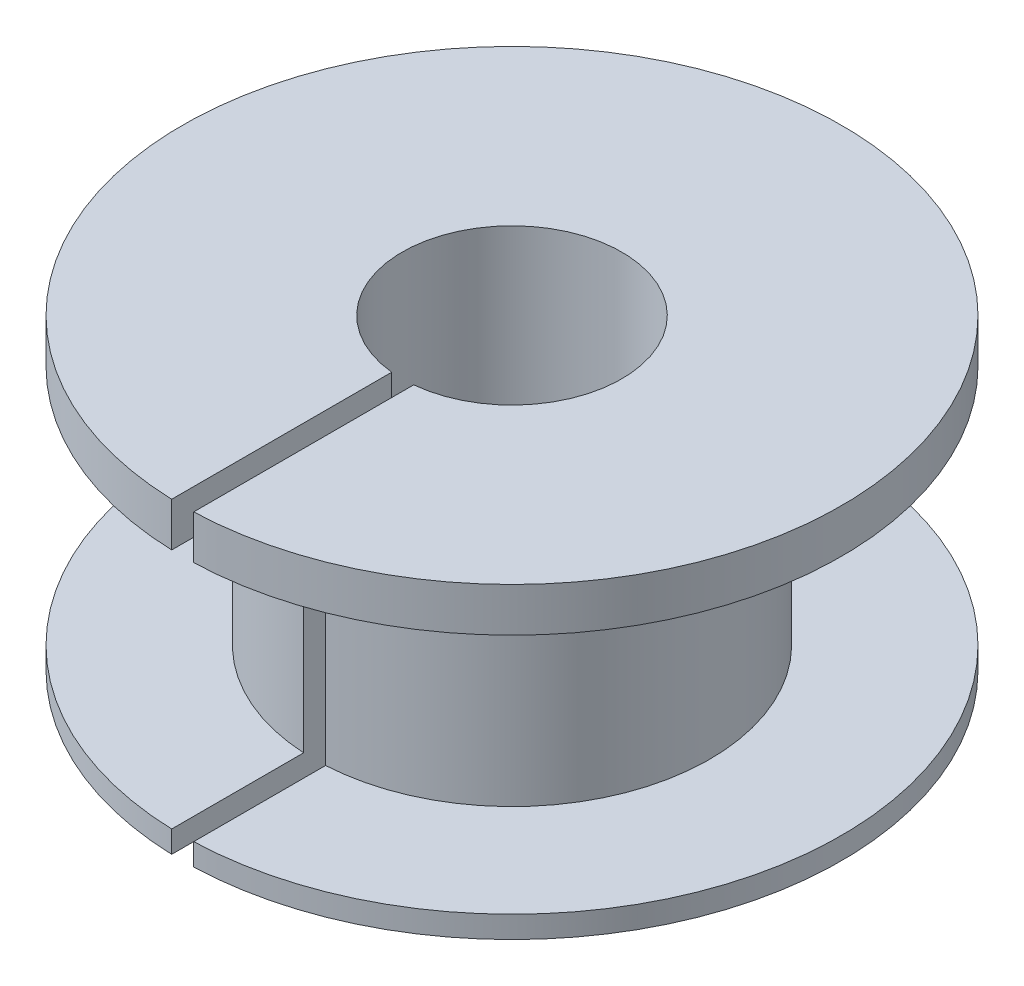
ISO-10303-21;
HEADER;
FILE_DESCRIPTION(('STEP AP214'),'2;1');
FILE_NAME('part.step','',(''),(''),'','','');
FILE_SCHEMA(('AUTOMOTIVE_DESIGN { 1 0 10303 214 1 1 1 1 }'));
ENDSEC;
DATA;
#1=APPLICATION_CONTEXT('core data for automotive mechanical design processes');
#2=APPLICATION_PROTOCOL_DEFINITION('international standard','automotive_design',2000,#1);
#3=PRODUCT_CONTEXT('',#1,'mechanical');
#4=PRODUCT('Part','Part','',(#3));
#5=PRODUCT_RELATED_PRODUCT_CATEGORY('part','',(#4));
#6=PRODUCT_DEFINITION_FORMATION('','',#4);
#7=PRODUCT_DEFINITION_CONTEXT('part definition',#1,'design');
#8=PRODUCT_DEFINITION('design','',#6,#7);
#9=PRODUCT_DEFINITION_SHAPE('','',#8);
#10=(LENGTH_UNIT() NAMED_UNIT(*) SI_UNIT(.MILLI.,.METRE.));
#11=(NAMED_UNIT(*) PLANE_ANGLE_UNIT() SI_UNIT($,.RADIAN.));
#12=(NAMED_UNIT(*) SI_UNIT($,.STERADIAN.) SOLID_ANGLE_UNIT());
#13=UNCERTAINTY_MEASURE_WITH_UNIT(LENGTH_MEASURE(1.E-05),#10,'distance_accuracy_value','');
#14=(GEOMETRIC_REPRESENTATION_CONTEXT(3) GLOBAL_UNCERTAINTY_ASSIGNED_CONTEXT((#13)) GLOBAL_UNIT_ASSIGNED_CONTEXT((#10,
#11,#12)) REPRESENTATION_CONTEXT('',''));
#15=CARTESIAN_POINT('',(0.,0.,0.));
#16=DIRECTION('',(0.,0.,1.));
#17=DIRECTION('',(1.,0.,0.));
#18=AXIS2_PLACEMENT_3D('',#15,#16,#17);
#19=CARTESIAN_POINT('',(-25.,70.,0.));
#20=DIRECTION('',(0.,-1.,0.));
#21=DIRECTION('',(0.,0.,-1.));
#22=AXIS2_PLACEMENT_3D('',#19,#20,#21);
#23=PLANE('',#22);
#24=DIRECTION('',(0.,0.,1.));
#25=VECTOR('',#24,1.);
#26=CARTESIAN_POINT('',(-2.5,70.,11.7845415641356));
#27=LINE('',#26,#25);
#28=CARTESIAN_POINT('',(-2.5,70.,24.8746859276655));
#29=VERTEX_POINT('',#28);
#30=CARTESIAN_POINT('',(-2.49999999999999,70.,74.9583217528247));
#31=VERTEX_POINT('',#30);
#32=EDGE_CURVE('E45',#29,#31,#27,.T.);
#33=ORIENTED_EDGE('',*,*,#32,.F.);
#34=CARTESIAN_POINT('',(0.,70.,0.));
#35=DIRECTION('',(0.,-1.,0.));
#36=DIRECTION('',(0.,0.,-1.));
#37=AXIS2_PLACEMENT_3D('',#34,#35,#36);
#38=CIRCLE('',#37,25.);
#39=CARTESIAN_POINT('',(2.5,70.,24.8746859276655));
#40=VERTEX_POINT('',#39);
#41=EDGE_CURVE('E108',#29,#40,#38,.T.);
#42=ORIENTED_EDGE('',*,*,#41,.T.);
#43=DIRECTION('',(0.,0.,-1.));
#44=VECTOR('',#43,1.);
#45=CARTESIAN_POINT('',(2.5,70.,11.7845415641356));
#46=LINE('',#45,#44);
#47=CARTESIAN_POINT('',(2.50000000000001,70.,74.9583217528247));
#48=VERTEX_POINT('',#47);
#49=EDGE_CURVE('E110',#48,#40,#46,.T.);
#50=ORIENTED_EDGE('',*,*,#49,.F.);
#51=CARTESIAN_POINT('',(0.,70.,0.));
#52=DIRECTION('',(0.,-1.,0.));
#53=DIRECTION('',(0.,0.,-1.));
#54=AXIS2_PLACEMENT_3D('',#51,#52,#53);
#55=CIRCLE('',#54,75.);
#56=EDGE_CURVE('E101',#31,#48,#55,.T.);
#57=ORIENTED_EDGE('',*,*,#56,.F.);
#58=EDGE_LOOP('',(#33,#42,#50,#57));
#59=FACE_BOUND('',#58,.T.);
#60=ADVANCED_FACE('F32',(#59),#23,.F.);
#61=CARTESIAN_POINT('',(0.,0.,0.));
#62=DIRECTION('',(0.,-1.,0.));
#63=DIRECTION('',(0.,0.,-1.));
#64=AXIS2_PLACEMENT_3D('',#61,#62,#63);
#65=CYLINDRICAL_SURFACE('',#64,25.);
#66=DIRECTION('',(0.,-1.,0.));
#67=VECTOR('',#66,1.);
#68=CARTESIAN_POINT('',(-2.5,0.,24.8746859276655));
#69=LINE('',#68,#67);
#70=CARTESIAN_POINT('',(-2.5,0.,24.8746859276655));
#71=VERTEX_POINT('',#70);
#72=EDGE_CURVE('E93',#71,#29,#69,.F.);
#73=ORIENTED_EDGE('',*,*,#72,.F.);
#74=CARTESIAN_POINT('',(0.,0.,0.));
#75=DIRECTION('',(0.,-1.,0.));
#76=DIRECTION('',(0.,0.,-1.));
#77=AXIS2_PLACEMENT_3D('',#74,#75,#76);
#78=CIRCLE('',#77,25.);
#79=CARTESIAN_POINT('',(2.5,0.,24.8746859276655));
#80=VERTEX_POINT('',#79);
#81=EDGE_CURVE('E116',#71,#80,#78,.T.);
#82=ORIENTED_EDGE('',*,*,#81,.T.);
#83=DIRECTION('',(0.,-1.,0.));
#84=VECTOR('',#83,1.);
#85=CARTESIAN_POINT('',(2.5,0.,24.8746859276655));
#86=LINE('',#85,#84);
#87=EDGE_CURVE('E115',#40,#80,#86,.T.);
#88=ORIENTED_EDGE('',*,*,#87,.F.);
#89=ORIENTED_EDGE('',*,*,#41,.F.);
#90=EDGE_LOOP('',(#73,#82,#88,#89));
#91=FACE_BOUND('',#90,.T.);
#92=ADVANCED_FACE('F114',(#91),#65,.F.);
#93=CARTESIAN_POINT('',(-25.,0.,0.));
#94=DIRECTION('',(0.,1.,0.));
#95=DIRECTION('',(0.,0.,1.));
#96=AXIS2_PLACEMENT_3D('',#93,#94,#95);
#97=PLANE('',#96);
#98=DIRECTION('',(0.,0.,1.));
#99=VECTOR('',#98,1.);
#100=CARTESIAN_POINT('',(-2.5,0.,11.7845415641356));
#101=LINE('',#100,#99);
#102=CARTESIAN_POINT('',(-2.49999999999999,0.,74.9583217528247));
#103=VERTEX_POINT('',#102);
#104=EDGE_CURVE('E96',#71,#103,#101,.T.);
#105=ORIENTED_EDGE('',*,*,#104,.T.);
#106=CARTESIAN_POINT('',(0.,0.,0.));
#107=DIRECTION('',(0.,-1.,0.));
#108=DIRECTION('',(0.,0.,-1.));
#109=AXIS2_PLACEMENT_3D('',#106,#107,#108);
#110=CIRCLE('',#109,75.);
#111=CARTESIAN_POINT('',(2.50000000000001,0.,74.9583217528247));
#112=VERTEX_POINT('',#111);
#113=EDGE_CURVE('E118',#103,#112,#110,.T.);
#114=ORIENTED_EDGE('',*,*,#113,.T.);
#115=DIRECTION('',(0.,0.,-1.));
#116=VECTOR('',#115,1.);
#117=CARTESIAN_POINT('',(2.5,0.,11.7845415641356));
#118=LINE('',#117,#116);
#119=EDGE_CURVE('E111',#112,#80,#118,.T.);
#120=ORIENTED_EDGE('',*,*,#119,.T.);
#121=ORIENTED_EDGE('',*,*,#81,.F.);
#122=EDGE_LOOP('',(#105,#114,#120,#121));
#123=FACE_BOUND('',#122,.T.);
#124=ADVANCED_FACE('F178',(#123),#97,.F.);
#125=CARTESIAN_POINT('',(0.,0.,0.));
#126=DIRECTION('',(0.,-1.,0.));
#127=DIRECTION('',(0.,0.,-1.));
#128=AXIS2_PLACEMENT_3D('',#125,#126,#127);
#129=CYLINDRICAL_SURFACE('',#128,75.);
#130=DIRECTION('',(0.,-1.,0.));
#131=VECTOR('',#130,1.);
#132=CARTESIAN_POINT('',(-2.49999999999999,0.,74.9583217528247));
#133=LINE('',#132,#131);
#134=CARTESIAN_POINT('',(-2.49999999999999,4.99999999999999,74.9583217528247));
#135=VERTEX_POINT('',#134);
#136=EDGE_CURVE('E102',#135,#103,#133,.T.);
#137=ORIENTED_EDGE('',*,*,#136,.F.);
#138=CARTESIAN_POINT('',(0.,4.99999999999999,0.));
#139=DIRECTION('',(0.,-1.,0.));
#140=DIRECTION('',(0.,0.,-1.));
#141=AXIS2_PLACEMENT_3D('',#138,#139,#140);
#142=CIRCLE('',#141,75.);
#143=CARTESIAN_POINT('',(2.50000000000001,4.99999999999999,74.9583217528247));
#144=VERTEX_POINT('',#143);
#145=EDGE_CURVE('E123',#135,#144,#142,.T.);
#146=ORIENTED_EDGE('',*,*,#145,.T.);
#147=DIRECTION('',(0.,-1.,0.));
#148=VECTOR('',#147,1.);
#149=CARTESIAN_POINT('',(2.50000000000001,0.,74.9583217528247));
#150=LINE('',#149,#148);
#151=EDGE_CURVE('E144',#112,#144,#150,.F.);
#152=ORIENTED_EDGE('',*,*,#151,.F.);
#153=ORIENTED_EDGE('',*,*,#113,.F.);
#154=EDGE_LOOP('',(#137,#146,#152,#153));
#155=FACE_BOUND('',#154,.T.);
#156=ADVANCED_FACE('F175',(#155),#129,.T.);
#157=CARTESIAN_POINT('',(-75.,4.99999999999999,0.));
#158=DIRECTION('',(0.,-1.,0.));
#159=DIRECTION('',(0.,0.,-1.));
#160=AXIS2_PLACEMENT_3D('',#157,#158,#159);
#161=PLANE('',#160);
#162=DIRECTION('',(0.,0.,1.));
#163=VECTOR('',#162,1.);
#164=CARTESIAN_POINT('',(-2.5,4.99999999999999,0.));
#165=LINE('',#164,#163);
#166=CARTESIAN_POINT('',(-2.49999999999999,4.99999999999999,44.9305018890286));
#167=VERTEX_POINT('',#166);
#168=EDGE_CURVE('E137',#167,#135,#165,.T.);
#169=ORIENTED_EDGE('',*,*,#168,.F.);
#170=CARTESIAN_POINT('',(0.,4.99999999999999,0.));
#171=DIRECTION('',(0.,-1.,0.));
#172=DIRECTION('',(0.,0.,-1.));
#173=AXIS2_PLACEMENT_3D('',#170,#171,#172);
#174=CIRCLE('',#173,45.);
#175=CARTESIAN_POINT('',(2.50000000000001,4.99999999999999,44.9305018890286));
#176=VERTEX_POINT('',#175);
#177=EDGE_CURVE('E126',#167,#176,#174,.T.);
#178=ORIENTED_EDGE('',*,*,#177,.T.);
#179=DIRECTION('',(0.,0.,-1.));
#180=VECTOR('',#179,1.);
#181=CARTESIAN_POINT('',(2.5,4.99999999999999,0.));
#182=LINE('',#181,#180);
#183=EDGE_CURVE('E146',#144,#176,#182,.T.);
#184=ORIENTED_EDGE('',*,*,#183,.F.);
#185=ORIENTED_EDGE('',*,*,#145,.F.);
#186=EDGE_LOOP('',(#169,#178,#184,#185));
#187=FACE_BOUND('',#186,.T.);
#188=ADVANCED_FACE('F171',(#187),#161,.F.);
#189=CARTESIAN_POINT('',(0.,0.,0.));
#190=DIRECTION('',(0.,-1.,0.));
#191=DIRECTION('',(0.,0.,-1.));
#192=AXIS2_PLACEMENT_3D('',#189,#190,#191);
#193=CYLINDRICAL_SURFACE('',#192,45.);
#194=DIRECTION('',(0.,-1.,0.));
#195=VECTOR('',#194,1.);
#196=CARTESIAN_POINT('',(-2.49999999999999,0.,44.9305018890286));
#197=LINE('',#196,#195);
#198=CARTESIAN_POINT('',(-2.5,60.,44.9305018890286));
#199=VERTEX_POINT('',#198);
#200=EDGE_CURVE('E139',#199,#167,#197,.T.);
#201=ORIENTED_EDGE('',*,*,#200,.F.);
#202=CARTESIAN_POINT('',(0.,60.,0.));
#203=DIRECTION('',(0.,-1.,0.));
#204=DIRECTION('',(0.,0.,-1.));
#205=AXIS2_PLACEMENT_3D('',#202,#203,#204);
#206=CIRCLE('',#205,45.);
#207=CARTESIAN_POINT('',(2.50000000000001,60.,44.9305018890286));
#208=VERTEX_POINT('',#207);
#209=EDGE_CURVE('E129',#199,#208,#206,.T.);
#210=ORIENTED_EDGE('',*,*,#209,.T.);
#211=DIRECTION('',(0.,-1.,0.));
#212=VECTOR('',#211,1.);
#213=CARTESIAN_POINT('',(2.50000000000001,0.,44.9305018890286));
#214=LINE('',#213,#212);
#215=EDGE_CURVE('E148',#176,#208,#214,.F.);
#216=ORIENTED_EDGE('',*,*,#215,.F.);
#217=ORIENTED_EDGE('',*,*,#177,.F.);
#218=EDGE_LOOP('',(#201,#210,#216,#217));
#219=FACE_BOUND('',#218,.T.);
#220=ADVANCED_FACE('F165',(#219),#193,.T.);
#221=CARTESIAN_POINT('',(-75.,60.,0.));
#222=DIRECTION('',(0.,1.,0.));
#223=DIRECTION('',(0.,0.,1.));
#224=AXIS2_PLACEMENT_3D('',#221,#222,#223);
#225=PLANE('',#224);
#226=DIRECTION('',(0.,0.,-1.));
#227=VECTOR('',#226,1.);
#228=CARTESIAN_POINT('',(-2.5,60.,0.));
#229=LINE('',#228,#227);
#230=CARTESIAN_POINT('',(-2.49999999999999,60.,74.9583217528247));
#231=VERTEX_POINT('',#230);
#232=EDGE_CURVE('E141',#231,#199,#229,.T.);
#233=ORIENTED_EDGE('',*,*,#232,.F.);
#234=CARTESIAN_POINT('',(0.,60.,0.));
#235=DIRECTION('',(0.,-1.,0.));
#236=DIRECTION('',(0.,0.,-1.));
#237=AXIS2_PLACEMENT_3D('',#234,#235,#236);
#238=CIRCLE('',#237,75.);
#239=CARTESIAN_POINT('',(2.50000000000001,60.,74.9583217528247));
#240=VERTEX_POINT('',#239);
#241=EDGE_CURVE('E132',#231,#240,#238,.T.);
#242=ORIENTED_EDGE('',*,*,#241,.T.);
#243=DIRECTION('',(0.,0.,1.));
#244=VECTOR('',#243,1.);
#245=CARTESIAN_POINT('',(2.5,60.,0.));
#246=LINE('',#245,#244);
#247=EDGE_CURVE('E53',#208,#240,#246,.T.);
#248=ORIENTED_EDGE('',*,*,#247,.F.);
#249=ORIENTED_EDGE('',*,*,#209,.F.);
#250=EDGE_LOOP('',(#233,#242,#248,#249));
#251=FACE_BOUND('',#250,.T.);
#252=ADVANCED_FACE('F162',(#251),#225,.F.);
#253=CARTESIAN_POINT('',(0.,0.,0.));
#254=DIRECTION('',(0.,-1.,0.));
#255=DIRECTION('',(0.,0.,-1.));
#256=AXIS2_PLACEMENT_3D('',#253,#254,#255);
#257=CYLINDRICAL_SURFACE('',#256,75.);
#258=DIRECTION('',(0.,-1.,0.));
#259=VECTOR('',#258,1.);
#260=CARTESIAN_POINT('',(-2.49999999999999,0.,74.9583217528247));
#261=LINE('',#260,#259);
#262=EDGE_CURVE('E11',#31,#231,#261,.T.);
#263=ORIENTED_EDGE('',*,*,#262,.F.);
#264=ORIENTED_EDGE('',*,*,#56,.T.);
#265=DIRECTION('',(0.,-1.,0.));
#266=VECTOR('',#265,1.);
#267=CARTESIAN_POINT('',(2.50000000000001,0.,74.9583217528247));
#268=LINE('',#267,#266);
#269=EDGE_CURVE('E39',#240,#48,#268,.F.);
#270=ORIENTED_EDGE('',*,*,#269,.F.);
#271=ORIENTED_EDGE('',*,*,#241,.F.);
#272=EDGE_LOOP('',(#263,#264,#270,#271));
#273=FACE_BOUND('',#272,.T.);
#274=ADVANCED_FACE('F156',(#273),#257,.T.);
#275=CARTESIAN_POINT('',(2.5,70.,11.7845415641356));
#276=DIRECTION('',(-1.,0.,0.));
#277=DIRECTION('',(0.,0.,1.));
#278=AXIS2_PLACEMENT_3D('',#275,#276,#277);
#279=PLANE('',#278);
#280=ORIENTED_EDGE('',*,*,#87,.T.);
#281=ORIENTED_EDGE('',*,*,#119,.F.);
#282=ORIENTED_EDGE('',*,*,#151,.T.);
#283=ORIENTED_EDGE('',*,*,#183,.T.);
#284=ORIENTED_EDGE('',*,*,#215,.T.);
#285=ORIENTED_EDGE('',*,*,#247,.T.);
#286=ORIENTED_EDGE('',*,*,#269,.T.);
#287=ORIENTED_EDGE('',*,*,#49,.T.);
#288=EDGE_LOOP('',(#280,#281,#282,#283,#284,#285,#286,#287));
#289=FACE_BOUND('',#288,.T.);
#290=ADVANCED_FACE('F154',(#289),#279,.T.);
#291=CARTESIAN_POINT('',(-2.5,70.,11.7845415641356));
#292=DIRECTION('',(1.,0.,0.));
#293=DIRECTION('',(0.,0.,-1.));
#294=AXIS2_PLACEMENT_3D('',#291,#292,#293);
#295=PLANE('',#294);
#296=ORIENTED_EDGE('',*,*,#72,.T.);
#297=ORIENTED_EDGE('',*,*,#32,.T.);
#298=ORIENTED_EDGE('',*,*,#262,.T.);
#299=ORIENTED_EDGE('',*,*,#232,.T.);
#300=ORIENTED_EDGE('',*,*,#200,.T.);
#301=ORIENTED_EDGE('',*,*,#168,.T.);
#302=ORIENTED_EDGE('',*,*,#136,.T.);
#303=ORIENTED_EDGE('',*,*,#104,.F.);
#304=EDGE_LOOP('',(#296,#297,#298,#299,#300,#301,#302,#303));
#305=FACE_BOUND('',#304,.T.);
#306=ADVANCED_FACE('F94',(#305),#295,.T.);
#307=CLOSED_SHELL('',(#60,#92,#124,#156,#188,#220,#252,#274,#290,#306));
#308=MANIFOLD_SOLID_BREP('B2',#307);
#309=ADVANCED_BREP_SHAPE_REPRESENTATION('',(#18,#308),#14);
#310=SHAPE_DEFINITION_REPRESENTATION(#9,#309);
ENDSEC;
END-ISO-10303-21;
